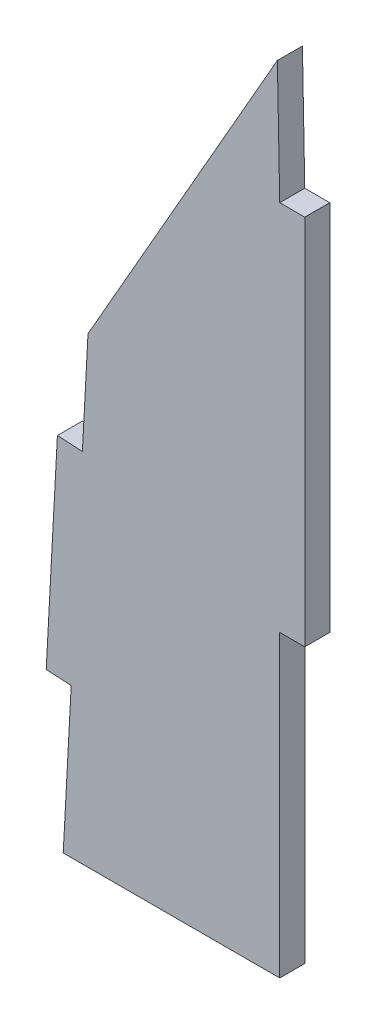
ISO-10303-21;
HEADER;
FILE_DESCRIPTION(('STEP AP214'),'2;1');
FILE_NAME('part.step','',(''),(''),'','','');
FILE_SCHEMA(('AUTOMOTIVE_DESIGN { 1 0 10303 214 1 1 1 1 }'));
ENDSEC;
DATA;
#1=APPLICATION_CONTEXT('core data for automotive mechanical design processes');
#2=APPLICATION_PROTOCOL_DEFINITION('international standard','automotive_design',2000,#1);
#3=PRODUCT_CONTEXT('',#1,'mechanical');
#4=PRODUCT('Part','Part','',(#3));
#5=PRODUCT_RELATED_PRODUCT_CATEGORY('part','',(#4));
#6=PRODUCT_DEFINITION_FORMATION('','',#4);
#7=PRODUCT_DEFINITION_CONTEXT('part definition',#1,'design');
#8=PRODUCT_DEFINITION('design','',#6,#7);
#9=PRODUCT_DEFINITION_SHAPE('','',#8);
#10=(LENGTH_UNIT() NAMED_UNIT(*) SI_UNIT(.MILLI.,.METRE.));
#11=(NAMED_UNIT(*) PLANE_ANGLE_UNIT() SI_UNIT($,.RADIAN.));
#12=(NAMED_UNIT(*) SI_UNIT($,.STERADIAN.) SOLID_ANGLE_UNIT());
#13=UNCERTAINTY_MEASURE_WITH_UNIT(LENGTH_MEASURE(1.E-05),#10,'distance_accuracy_value','');
#14=(GEOMETRIC_REPRESENTATION_CONTEXT(3) GLOBAL_UNCERTAINTY_ASSIGNED_CONTEXT((#13)) GLOBAL_UNIT_ASSIGNED_CONTEXT((#10,
#11,#12)) REPRESENTATION_CONTEXT('',''));
#15=CARTESIAN_POINT('',(0.,0.,0.));
#16=DIRECTION('',(0.,0.,1.));
#17=DIRECTION('',(1.,0.,0.));
#18=AXIS2_PLACEMENT_3D('',#15,#16,#17);
#19=CARTESIAN_POINT('',(0.,38.7700402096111,1.524));
#20=DIRECTION('',(-0.999815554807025,-0.0192056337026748,0.));
#21=DIRECTION('',(0.0192056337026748,-0.999815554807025,0.));
#22=AXIS2_PLACEMENT_3D('',#19,#20,#21);
#23=PLANE('',#22);
#24=DIRECTION('',(-0.0192056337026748,0.999815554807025,0.));
#25=VECTOR('',#24,1.);
#26=CARTESIAN_POINT('',(0.,38.7700402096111,0.));
#27=LINE('',#26,#25);
#28=CARTESIAN_POINT('',(0.,38.7700402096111,0.));
#29=VERTEX_POINT('',#28);
#30=CARTESIAN_POINT('',(-0.142706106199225,46.1990991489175,0.));
#31=VERTEX_POINT('',#30);
#32=EDGE_CURVE('E154',#29,#31,#27,.T.);
#33=ORIENTED_EDGE('',*,*,#32,.T.);
#34=DIRECTION('',(0.,0.,-1.));
#35=VECTOR('',#34,1.);
#36=CARTESIAN_POINT('',(-0.142706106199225,46.1990991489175,1.524));
#37=LINE('',#36,#35);
#38=CARTESIAN_POINT('',(-0.142706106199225,46.1990991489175,1.524));
#39=VERTEX_POINT('',#38);
#40=EDGE_CURVE('E11',#39,#31,#37,.T.);
#41=ORIENTED_EDGE('',*,*,#40,.F.);
#42=DIRECTION('',(-0.0192056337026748,0.999815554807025,0.));
#43=VECTOR('',#42,1.);
#44=CARTESIAN_POINT('',(0.,38.7700402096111,1.524));
#45=LINE('',#44,#43);
#46=CARTESIAN_POINT('',(0.,38.7700402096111,1.524));
#47=VERTEX_POINT('',#46);
#48=EDGE_CURVE('E176',#47,#39,#45,.T.);
#49=ORIENTED_EDGE('',*,*,#48,.F.);
#50=DIRECTION('',(0.,0.,-1.));
#51=VECTOR('',#50,1.);
#52=CARTESIAN_POINT('',(0.,38.7700402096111,1.524));
#53=LINE('',#52,#51);
#54=EDGE_CURVE('E150',#47,#29,#53,.T.);
#55=ORIENTED_EDGE('',*,*,#54,.T.);
#56=EDGE_LOOP('',(#33,#41,#49,#55));
#57=FACE_BOUND('',#56,.T.);
#58=ADVANCED_FACE('F34',(#57),#23,.F.);
#59=CARTESIAN_POINT('',(-0.142706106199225,46.1990991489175,1.524));
#60=DIRECTION('',(0.868171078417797,-0.496265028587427,0.));
#61=DIRECTION('',(0.496265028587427,0.868171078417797,0.));
#62=AXIS2_PLACEMENT_3D('',#59,#60,#61);
#63=PLANE('',#62);
#64=DIRECTION('',(-0.496265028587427,-0.868171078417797,0.));
#65=VECTOR('',#64,1.);
#66=CARTESIAN_POINT('',(-0.142706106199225,46.1990991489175,0.));
#67=LINE('',#66,#65);
#68=CARTESIAN_POINT('',(-11.6733847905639,26.0272128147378,0.));
#69=VERTEX_POINT('',#68);
#70=EDGE_CURVE('E157',#31,#69,#67,.T.);
#71=ORIENTED_EDGE('',*,*,#70,.T.);
#72=DIRECTION('',(0.,0.,-1.));
#73=VECTOR('',#72,1.);
#74=CARTESIAN_POINT('',(-11.6733847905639,26.0272128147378,1.524));
#75=LINE('',#74,#73);
#76=CARTESIAN_POINT('',(-11.6733847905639,26.0272128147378,1.524));
#77=VERTEX_POINT('',#76);
#78=EDGE_CURVE('E42',#77,#69,#75,.T.);
#79=ORIENTED_EDGE('',*,*,#78,.F.);
#80=DIRECTION('',(-0.496265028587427,-0.868171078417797,0.));
#81=VECTOR('',#80,1.);
#82=CARTESIAN_POINT('',(-0.142706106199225,46.1990991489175,1.524));
#83=LINE('',#82,#81);
#84=EDGE_CURVE('E105',#39,#77,#83,.T.);
#85=ORIENTED_EDGE('',*,*,#84,.F.);
#86=ORIENTED_EDGE('',*,*,#40,.T.);
#87=EDGE_LOOP('',(#71,#79,#85,#86));
#88=FACE_BOUND('',#87,.T.);
#89=ADVANCED_FACE('F254',(#88),#63,.F.);
#90=CARTESIAN_POINT('',(-11.6733847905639,26.0272128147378,1.524));
#91=DIRECTION('',(0.998563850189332,-0.0535745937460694,0.));
#92=DIRECTION('',(0.0535745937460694,0.998563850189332,0.));
#93=AXIS2_PLACEMENT_3D('',#90,#91,#92);
#94=PLANE('',#93);
#95=DIRECTION('',(-0.0535745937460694,-0.998563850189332,0.));
#96=VECTOR('',#95,1.);
#97=CARTESIAN_POINT('',(-11.6733847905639,26.0272128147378,0.));
#98=LINE('',#97,#96);
#99=CARTESIAN_POINT('',(-12.0158922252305,19.643299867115,0.));
#100=VERTEX_POINT('',#99);
#101=EDGE_CURVE('E159',#69,#100,#98,.T.);
#102=ORIENTED_EDGE('',*,*,#101,.T.);
#103=DIRECTION('',(0.,0.,-1.));
#104=VECTOR('',#103,1.);
#105=CARTESIAN_POINT('',(-12.0158922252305,19.643299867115,1.524));
#106=LINE('',#105,#104);
#107=CARTESIAN_POINT('',(-12.0158922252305,19.643299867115,1.524));
#108=VERTEX_POINT('',#107);
#109=EDGE_CURVE('E195',#108,#100,#106,.T.);
#110=ORIENTED_EDGE('',*,*,#109,.F.);
#111=DIRECTION('',(-0.0535745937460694,-0.998563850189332,0.));
#112=VECTOR('',#111,1.);
#113=CARTESIAN_POINT('',(-11.6733847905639,26.0272128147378,1.524));
#114=LINE('',#113,#112);
#115=EDGE_CURVE('E203',#77,#108,#114,.T.);
#116=ORIENTED_EDGE('',*,*,#115,.F.);
#117=ORIENTED_EDGE('',*,*,#78,.T.);
#118=EDGE_LOOP('',(#102,#110,#116,#117));
#119=FACE_BOUND('',#118,.T.);
#120=ADVANCED_FACE('F201',(#119),#94,.F.);
#121=CARTESIAN_POINT('',(-12.0158922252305,19.643299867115,1.524));
#122=DIRECTION('',(-0.053574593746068,-0.998563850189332,0.));
#123=DIRECTION('',(0.998563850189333,-0.053574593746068,0.));
#124=AXIS2_PLACEMENT_3D('',#121,#122,#123);
#125=PLANE('',#124);
#126=DIRECTION('',(-0.998563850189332,0.053574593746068,0.));
#127=VECTOR('',#126,1.);
#128=CARTESIAN_POINT('',(-12.0158922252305,19.643299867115,0.));
#129=LINE('',#128,#127);
#130=CARTESIAN_POINT('',(-13.5377035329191,19.724947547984,0.));
#131=VERTEX_POINT('',#130);
#132=EDGE_CURVE('E161',#100,#131,#129,.T.);
#133=ORIENTED_EDGE('',*,*,#132,.T.);
#134=DIRECTION('',(0.,0.,-1.));
#135=VECTOR('',#134,1.);
#136=CARTESIAN_POINT('',(-13.5377035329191,19.724947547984,1.524));
#137=LINE('',#136,#135);
#138=CARTESIAN_POINT('',(-13.5377035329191,19.724947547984,1.524));
#139=VERTEX_POINT('',#138);
#140=EDGE_CURVE('E192',#139,#131,#137,.T.);
#141=ORIENTED_EDGE('',*,*,#140,.F.);
#142=DIRECTION('',(-0.998563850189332,0.053574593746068,0.));
#143=VECTOR('',#142,1.);
#144=CARTESIAN_POINT('',(-12.0158922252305,19.643299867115,1.524));
#145=LINE('',#144,#143);
#146=EDGE_CURVE('E221',#108,#139,#145,.T.);
#147=ORIENTED_EDGE('',*,*,#146,.F.);
#148=ORIENTED_EDGE('',*,*,#109,.T.);
#149=EDGE_LOOP('',(#133,#141,#147,#148));
#150=FACE_BOUND('',#149,.T.);
#151=ADVANCED_FACE('F212',(#150),#125,.F.);
#152=CARTESIAN_POINT('',(-13.5377035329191,19.724947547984,1.524));
#153=DIRECTION('',(0.998563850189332,-0.053574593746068,0.));
#154=DIRECTION('',(0.053574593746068,0.998563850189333,0.));
#155=AXIS2_PLACEMENT_3D('',#152,#153,#154);
#156=PLANE('',#155);
#157=DIRECTION('',(-0.053574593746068,-0.998563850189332,0.));
#158=VECTOR('',#157,1.);
#159=CARTESIAN_POINT('',(-13.5377035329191,19.724947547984,0.));
#160=LINE('',#159,#158);
#161=CARTESIAN_POINT('',(-14.2181008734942,7.04318665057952,0.));
#162=VERTEX_POINT('',#161);
#163=EDGE_CURVE('E163',#131,#162,#160,.T.);
#164=ORIENTED_EDGE('',*,*,#163,.T.);
#165=DIRECTION('',(0.,0.,-1.));
#166=VECTOR('',#165,1.);
#167=CARTESIAN_POINT('',(-14.2181008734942,7.04318665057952,1.524));
#168=LINE('',#167,#166);
#169=CARTESIAN_POINT('',(-14.2181008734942,7.04318665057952,1.524));
#170=VERTEX_POINT('',#169);
#171=EDGE_CURVE('E189',#170,#162,#168,.T.);
#172=ORIENTED_EDGE('',*,*,#171,.F.);
#173=DIRECTION('',(-0.053574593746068,-0.998563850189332,0.));
#174=VECTOR('',#173,1.);
#175=CARTESIAN_POINT('',(-13.5377035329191,19.724947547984,1.524));
#176=LINE('',#175,#174);
#177=EDGE_CURVE('E218',#139,#170,#176,.T.);
#178=ORIENTED_EDGE('',*,*,#177,.F.);
#179=ORIENTED_EDGE('',*,*,#140,.T.);
#180=EDGE_LOOP('',(#164,#172,#178,#179));
#181=FACE_BOUND('',#180,.T.);
#182=ADVANCED_FACE('F216',(#181),#156,.F.);
#183=CARTESIAN_POINT('',(-12.6962895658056,6.96153896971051,1.524));
#184=DIRECTION('',(0.053574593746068,0.998563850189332,0.));
#185=DIRECTION('',(-0.998563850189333,0.053574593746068,0.));
#186=AXIS2_PLACEMENT_3D('',#183,#184,#185);
#187=PLANE('',#186);
#188=DIRECTION('',(0.998563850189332,-0.053574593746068,0.));
#189=VECTOR('',#188,1.);
#190=CARTESIAN_POINT('',(-12.6962895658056,6.96153896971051,0.));
#191=LINE('',#190,#189);
#192=CARTESIAN_POINT('',(-12.6962895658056,6.96153896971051,0.));
#193=VERTEX_POINT('',#192);
#194=EDGE_CURVE('E165',#162,#193,#191,.T.);
#195=ORIENTED_EDGE('',*,*,#194,.T.);
#196=DIRECTION('',(0.,0.,-1.));
#197=VECTOR('',#196,1.);
#198=CARTESIAN_POINT('',(-12.6962895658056,6.96153896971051,1.524));
#199=LINE('',#198,#197);
#200=CARTESIAN_POINT('',(-12.6962895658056,6.96153896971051,1.524));
#201=VERTEX_POINT('',#200);
#202=EDGE_CURVE('E186',#201,#193,#199,.T.);
#203=ORIENTED_EDGE('',*,*,#202,.F.);
#204=DIRECTION('',(0.998563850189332,-0.053574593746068,0.));
#205=VECTOR('',#204,1.);
#206=CARTESIAN_POINT('',(-12.6962895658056,6.96153896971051,1.524));
#207=LINE('',#206,#205);
#208=EDGE_CURVE('E220',#170,#201,#207,.T.);
#209=ORIENTED_EDGE('',*,*,#208,.F.);
#210=ORIENTED_EDGE('',*,*,#171,.T.);
#211=EDGE_LOOP('',(#195,#203,#209,#210));
#212=FACE_BOUND('',#211,.T.);
#213=ADVANCED_FACE('F267',(#212),#187,.F.);
#214=CARTESIAN_POINT('',(-12.6962895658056,6.96153896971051,1.524));
#215=DIRECTION('',(0.998563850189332,-0.0535745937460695,0.));
#216=DIRECTION('',(0.0535745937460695,0.998563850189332,0.));
#217=AXIS2_PLACEMENT_3D('',#214,#215,#216);
#218=PLANE('',#217);
#219=DIRECTION('',(-0.0535745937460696,-0.998563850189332,0.));
#220=VECTOR('',#219,1.);
#221=CARTESIAN_POINT('',(-12.6962895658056,6.96153896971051,0.));
#222=LINE('',#221,#220);
#223=CARTESIAN_POINT('',(-13.183143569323,-2.11281464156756,0.));
#224=VERTEX_POINT('',#223);
#225=EDGE_CURVE('E167',#193,#224,#222,.T.);
#226=ORIENTED_EDGE('',*,*,#225,.T.);
#227=DIRECTION('',(0.,0.,-1.));
#228=VECTOR('',#227,1.);
#229=CARTESIAN_POINT('',(-13.183143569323,-2.11281464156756,1.524));
#230=LINE('',#229,#228);
#231=CARTESIAN_POINT('',(-13.183143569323,-2.11281464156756,1.524));
#232=VERTEX_POINT('',#231);
#233=EDGE_CURVE('E183',#232,#224,#230,.T.);
#234=ORIENTED_EDGE('',*,*,#233,.F.);
#235=DIRECTION('',(-0.0535745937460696,-0.998563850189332,0.));
#236=VECTOR('',#235,1.);
#237=CARTESIAN_POINT('',(-12.6962895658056,6.96153896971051,1.524));
#238=LINE('',#237,#236);
#239=EDGE_CURVE('E223',#201,#232,#238,.T.);
#240=ORIENTED_EDGE('',*,*,#239,.F.);
#241=ORIENTED_EDGE('',*,*,#202,.T.);
#242=EDGE_LOOP('',(#226,#234,#240,#241));
#243=FACE_BOUND('',#242,.T.);
#244=ADVANCED_FACE('F270',(#243),#218,.F.);
#245=CARTESIAN_POINT('',(0.,-2.11281464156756,1.524));
#246=DIRECTION('',(0.,1.,0.));
#247=DIRECTION('',(-1.,0.,0.));
#248=AXIS2_PLACEMENT_3D('',#245,#246,#247);
#249=PLANE('',#248);
#250=DIRECTION('',(1.,0.,0.));
#251=VECTOR('',#250,1.);
#252=CARTESIAN_POINT('',(0.,-2.11281464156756,0.));
#253=LINE('',#252,#251);
#254=CARTESIAN_POINT('',(0.,-2.11281464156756,0.));
#255=VERTEX_POINT('',#254);
#256=EDGE_CURVE('E169',#224,#255,#253,.T.);
#257=ORIENTED_EDGE('',*,*,#256,.T.);
#258=DIRECTION('',(0.,0.,-1.));
#259=VECTOR('',#258,1.);
#260=CARTESIAN_POINT('',(0.,-2.11281464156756,1.524));
#261=LINE('',#260,#259);
#262=CARTESIAN_POINT('',(0.,-2.11281464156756,1.524));
#263=VERTEX_POINT('',#262);
#264=EDGE_CURVE('E180',#263,#255,#261,.T.);
#265=ORIENTED_EDGE('',*,*,#264,.F.);
#266=DIRECTION('',(1.,0.,0.));
#267=VECTOR('',#266,1.);
#268=CARTESIAN_POINT('',(0.,-2.11281464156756,1.524));
#269=LINE('',#268,#267);
#270=EDGE_CURVE('E229',#232,#263,#269,.T.);
#271=ORIENTED_EDGE('',*,*,#270,.F.);
#272=ORIENTED_EDGE('',*,*,#233,.T.);
#273=EDGE_LOOP('',(#257,#265,#271,#272));
#274=FACE_BOUND('',#273,.T.);
#275=ADVANCED_FACE('F235',(#274),#249,.F.);
#276=CARTESIAN_POINT('',(0.,16.1110893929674,1.524));
#277=DIRECTION('',(-1.,0.,0.));
#278=DIRECTION('',(0.,-1.,0.));
#279=AXIS2_PLACEMENT_3D('',#276,#277,#278);
#280=PLANE('',#279);
#281=DIRECTION('',(0.,1.,0.));
#282=VECTOR('',#281,1.);
#283=CARTESIAN_POINT('',(0.,16.1110893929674,0.));
#284=LINE('',#283,#282);
#285=CARTESIAN_POINT('',(0.,16.1110893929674,0.));
#286=VERTEX_POINT('',#285);
#287=EDGE_CURVE('E171',#255,#286,#284,.T.);
#288=ORIENTED_EDGE('',*,*,#287,.T.);
#289=DIRECTION('',(0.,0.,-1.));
#290=VECTOR('',#289,1.);
#291=CARTESIAN_POINT('',(0.,16.1110893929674,1.524));
#292=LINE('',#291,#290);
#293=CARTESIAN_POINT('',(0.,16.1110893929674,1.524));
#294=VERTEX_POINT('',#293);
#295=EDGE_CURVE('E145',#294,#286,#292,.T.);
#296=ORIENTED_EDGE('',*,*,#295,.F.);
#297=DIRECTION('',(0.,1.,0.));
#298=VECTOR('',#297,1.);
#299=CARTESIAN_POINT('',(0.,16.1110893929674,1.524));
#300=LINE('',#299,#298);
#301=EDGE_CURVE('E136',#263,#294,#300,.T.);
#302=ORIENTED_EDGE('',*,*,#301,.F.);
#303=ORIENTED_EDGE('',*,*,#264,.T.);
#304=EDGE_LOOP('',(#288,#296,#302,#303));
#305=FACE_BOUND('',#304,.T.);
#306=ADVANCED_FACE('F239',(#305),#280,.F.);
#307=CARTESIAN_POINT('',(1.52399999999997,16.1110893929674,1.524));
#308=DIRECTION('',(0.,1.,0.));
#309=DIRECTION('',(0.,0.,1.));
#310=AXIS2_PLACEMENT_3D('',#307,#308,#309);
#311=PLANE('',#310);
#312=DIRECTION('',(1.,0.,0.));
#313=VECTOR('',#312,1.);
#314=CARTESIAN_POINT('',(1.52399999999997,16.1110893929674,0.));
#315=LINE('',#314,#313);
#316=CARTESIAN_POINT('',(1.52399999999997,16.1110893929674,0.));
#317=VERTEX_POINT('',#316);
#318=EDGE_CURVE('E144',#286,#317,#315,.T.);
#319=ORIENTED_EDGE('',*,*,#318,.T.);
#320=DIRECTION('',(0.,0.,-1.));
#321=VECTOR('',#320,1.);
#322=CARTESIAN_POINT('',(1.52399999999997,16.1110893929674,1.524));
#323=LINE('',#322,#321);
#324=CARTESIAN_POINT('',(1.52399999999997,16.1110893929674,1.524));
#325=VERTEX_POINT('',#324);
#326=EDGE_CURVE('E141',#325,#317,#323,.T.);
#327=ORIENTED_EDGE('',*,*,#326,.F.);
#328=DIRECTION('',(1.,0.,0.));
#329=VECTOR('',#328,1.);
#330=CARTESIAN_POINT('',(1.52399999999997,16.1110893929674,1.524));
#331=LINE('',#330,#329);
#332=EDGE_CURVE('E130',#294,#325,#331,.T.);
#333=ORIENTED_EDGE('',*,*,#332,.F.);
#334=ORIENTED_EDGE('',*,*,#295,.T.);
#335=EDGE_LOOP('',(#319,#327,#333,#334));
#336=FACE_BOUND('',#335,.T.);
#337=ADVANCED_FACE('F142',(#336),#311,.F.);
#338=CARTESIAN_POINT('',(1.52399999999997,38.7700402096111,1.524));
#339=DIRECTION('',(-1.,0.,0.));
#340=DIRECTION('',(0.,0.,1.));
#341=AXIS2_PLACEMENT_3D('',#338,#339,#340);
#342=PLANE('',#341);
#343=DIRECTION('',(0.,1.,0.));
#344=VECTOR('',#343,1.);
#345=CARTESIAN_POINT('',(1.52399999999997,38.7700402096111,0.));
#346=LINE('',#345,#344);
#347=CARTESIAN_POINT('',(1.52399999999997,38.7700402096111,0.));
#348=VERTEX_POINT('',#347);
#349=EDGE_CURVE('E91',#317,#348,#346,.T.);
#350=ORIENTED_EDGE('',*,*,#349,.T.);
#351=DIRECTION('',(0.,0.,-1.));
#352=VECTOR('',#351,1.);
#353=CARTESIAN_POINT('',(1.52399999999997,38.7700402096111,1.524));
#354=LINE('',#353,#352);
#355=CARTESIAN_POINT('',(1.52399999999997,38.7700402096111,1.524));
#356=VERTEX_POINT('',#355);
#357=EDGE_CURVE('E146',#356,#348,#354,.T.);
#358=ORIENTED_EDGE('',*,*,#357,.F.);
#359=DIRECTION('',(0.,1.,0.));
#360=VECTOR('',#359,1.);
#361=CARTESIAN_POINT('',(1.52399999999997,38.7700402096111,1.524));
#362=LINE('',#361,#360);
#363=EDGE_CURVE('E134',#325,#356,#362,.T.);
#364=ORIENTED_EDGE('',*,*,#363,.F.);
#365=ORIENTED_EDGE('',*,*,#326,.T.);
#366=EDGE_LOOP('',(#350,#358,#364,#365));
#367=FACE_BOUND('',#366,.T.);
#368=ADVANCED_FACE('F148',(#367),#342,.F.);
#369=CARTESIAN_POINT('',(0.,38.7700402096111,1.524));
#370=DIRECTION('',(0.,-1.,0.));
#371=DIRECTION('',(0.,0.,-1.));
#372=AXIS2_PLACEMENT_3D('',#369,#370,#371);
#373=PLANE('',#372);
#374=DIRECTION('',(-1.,0.,0.));
#375=VECTOR('',#374,1.);
#376=CARTESIAN_POINT('',(0.,38.7700402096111,0.));
#377=LINE('',#376,#375);
#378=EDGE_CURVE('E97',#348,#29,#377,.T.);
#379=ORIENTED_EDGE('',*,*,#378,.T.);
#380=ORIENTED_EDGE('',*,*,#54,.F.);
#381=DIRECTION('',(-1.,0.,0.));
#382=VECTOR('',#381,1.);
#383=CARTESIAN_POINT('',(0.,38.7700402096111,1.524));
#384=LINE('',#383,#382);
#385=EDGE_CURVE('E50',#356,#47,#384,.T.);
#386=ORIENTED_EDGE('',*,*,#385,.F.);
#387=ORIENTED_EDGE('',*,*,#357,.T.);
#388=EDGE_LOOP('',(#379,#380,#386,#387));
#389=FACE_BOUND('',#388,.T.);
#390=ADVANCED_FACE('F243',(#389),#373,.F.);
#391=CARTESIAN_POINT('',(0.,0.,1.524));
#392=DIRECTION('',(0.,0.,1.));
#393=DIRECTION('',(1.,0.,0.));
#394=AXIS2_PLACEMENT_3D('',#391,#392,#393);
#395=PLANE('',#394);
#396=ORIENTED_EDGE('',*,*,#48,.T.);
#397=ORIENTED_EDGE('',*,*,#84,.T.);
#398=ORIENTED_EDGE('',*,*,#115,.T.);
#399=ORIENTED_EDGE('',*,*,#146,.T.);
#400=ORIENTED_EDGE('',*,*,#177,.T.);
#401=ORIENTED_EDGE('',*,*,#208,.T.);
#402=ORIENTED_EDGE('',*,*,#239,.T.);
#403=ORIENTED_EDGE('',*,*,#270,.T.);
#404=ORIENTED_EDGE('',*,*,#301,.T.);
#405=ORIENTED_EDGE('',*,*,#332,.T.);
#406=ORIENTED_EDGE('',*,*,#363,.T.);
#407=ORIENTED_EDGE('',*,*,#385,.T.);
#408=EDGE_LOOP('',(#396,#397,#398,#399,#400,#401,#402,#403,#404,#405,#406,#407));
#409=FACE_BOUND('',#408,.T.);
#410=ADVANCED_FACE('F132',(#409),#395,.T.);
#411=CARTESIAN_POINT('',(0.,0.,0.));
#412=DIRECTION('',(0.,0.,1.));
#413=DIRECTION('',(1.,0.,0.));
#414=AXIS2_PLACEMENT_3D('',#411,#412,#413);
#415=PLANE('',#414);
#416=ORIENTED_EDGE('',*,*,#32,.F.);
#417=ORIENTED_EDGE('',*,*,#378,.F.);
#418=ORIENTED_EDGE('',*,*,#349,.F.);
#419=ORIENTED_EDGE('',*,*,#318,.F.);
#420=ORIENTED_EDGE('',*,*,#287,.F.);
#421=ORIENTED_EDGE('',*,*,#256,.F.);
#422=ORIENTED_EDGE('',*,*,#225,.F.);
#423=ORIENTED_EDGE('',*,*,#194,.F.);
#424=ORIENTED_EDGE('',*,*,#163,.F.);
#425=ORIENTED_EDGE('',*,*,#132,.F.);
#426=ORIENTED_EDGE('',*,*,#101,.F.);
#427=ORIENTED_EDGE('',*,*,#70,.F.);
#428=EDGE_LOOP('',(#416,#417,#418,#419,#420,#421,#422,#423,#424,#425,#426,#427));
#429=FACE_BOUND('',#428,.T.);
#430=ADVANCED_FACE('F207',(#429),#415,.F.);
#431=CLOSED_SHELL('',(#58,#89,#120,#151,#182,#213,#244,#275,#306,#337,#368,#390,#410,#430));
#432=MANIFOLD_SOLID_BREP('B2',#431);
#433=ADVANCED_BREP_SHAPE_REPRESENTATION('',(#18,#432),#14);
#434=SHAPE_DEFINITION_REPRESENTATION(#9,#433);
ENDSEC;
END-ISO-10303-21;
